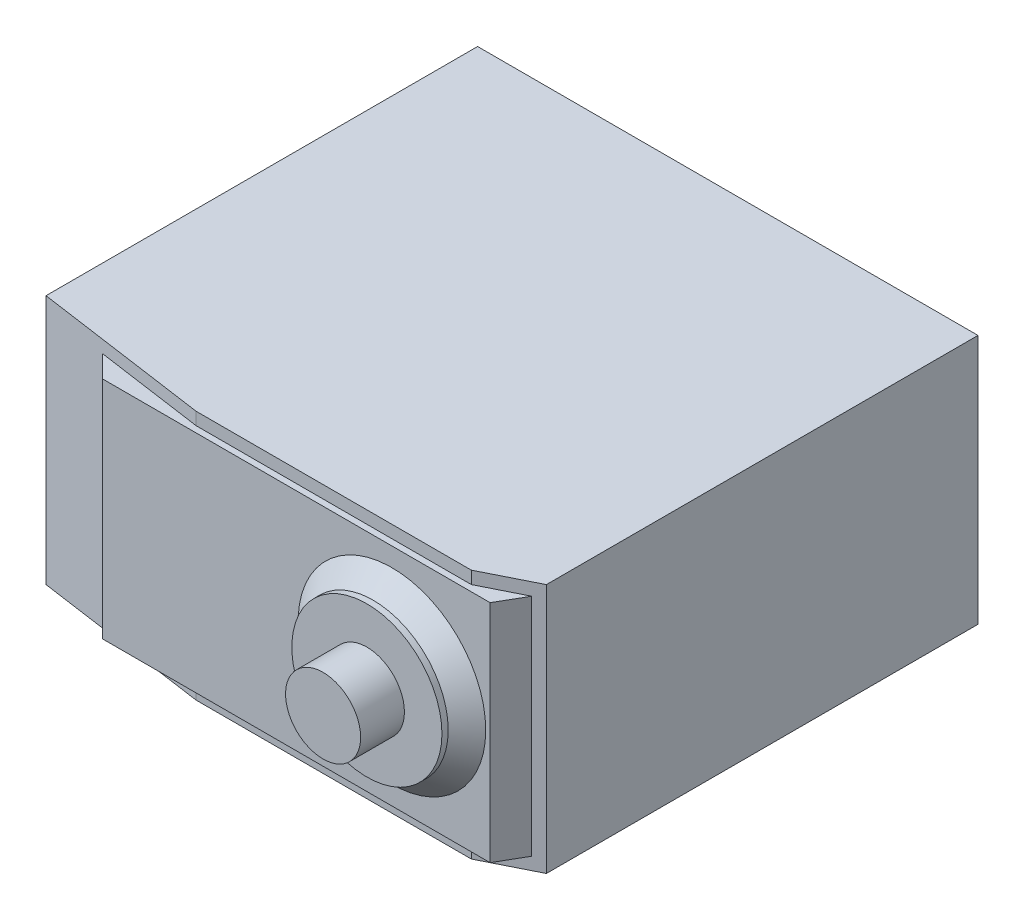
from build123d import *

# Parameters (mm, degrees)
ESQUISSE1_W             = 40
ESQUISSE1_H             = 20
BOSS_EXTRU_1_DEPTH      = 36.5
ENL_V_MAT_EXTRU_1_DEPTH = 47.176292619
ESQUISSE3_W             = 31
ESQUISSE3_H             = 18
BOSS_EXTRU_2_DEPTH      = 5
BOSS_EXTRU_3_DEPTH      = 18
ESQUISSE5_R             = 6
BOSS_EXTRU_4_DEPTH      = 2
CHANFREIN1_SIZE         = 1.5
ESQUISSE6_R             = 3
BOSS_EXTRU_5_DEPTH      = 3.5


with BuildPart() as part:
    # Esquisse1 → Boss.-Extru.1 (new body)
    with BuildSketch(Plane.XY):
        Rectangle(ESQUISSE1_W, ESQUISSE1_H)
    extrude(amount=BOSS_EXTRU_1_DEPTH)

    # Esquisse2 → Enl_v. mat.-Extru.1 (cut, through all)
    with BuildSketch(Plane.XZ.offset(10)):
        Polygon((-20, 36.5), (-6, 36.5), (-20, 34.5), align=None)
        Polygon((16, 36.5), (20, 36.5), (20, 34.5), align=None)
    extrude(amount=-ENL_V_MAT_EXTRU_1_DEPTH, mode=Mode.SUBTRACT)

    # Esquisse3 → Boss.-Extru.2 (add)
    with BuildSketch(Plane.XY.offset(37)):
        with Locations((2.5, 0)):
            Rectangle(ESQUISSE3_W, ESQUISSE3_H)
    extrude(amount=-BOSS_EXTRU_2_DEPTH)

    # Esquisse4 → Boss.-Extru.3 (add)
    with BuildSketch(Plane.XZ.offset(9)):
        Polygon((-13, 37), (-16.971189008, 33.028810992), (-13, 33.028810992), align=None)
        Polygon((18, 37), (19.545966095, 34.322308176), (18, 34.322308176), align=None)
    extrude(amount=-BOSS_EXTRU_3_DEPTH)

    # Esquisse5 → Boss.-Extru.4 (add)
    with BuildSketch(Plane.XY.offset(37)):
        with Locations((10.15, 0)):
            Circle(ESQUISSE5_R)
    extrude(amount=BOSS_EXTRU_4_DEPTH)

    # Chanfrein1
    chanfrein1_edges = [part.edges().sort_by_distance(p)[0] for p in [
        (4.15, 0, 37),
    ]]
    chamfer(chanfrein1_edges, length=CHANFREIN1_SIZE)

    # Esquisse6 → Boss.-Extru.5 (add)
    with BuildSketch(Plane.XY.offset(39)):
        with Locations((10.15, 0)):
            Circle(ESQUISSE6_R)
    extrude(amount=BOSS_EXTRU_5_DEPTH)


solid = part.part
